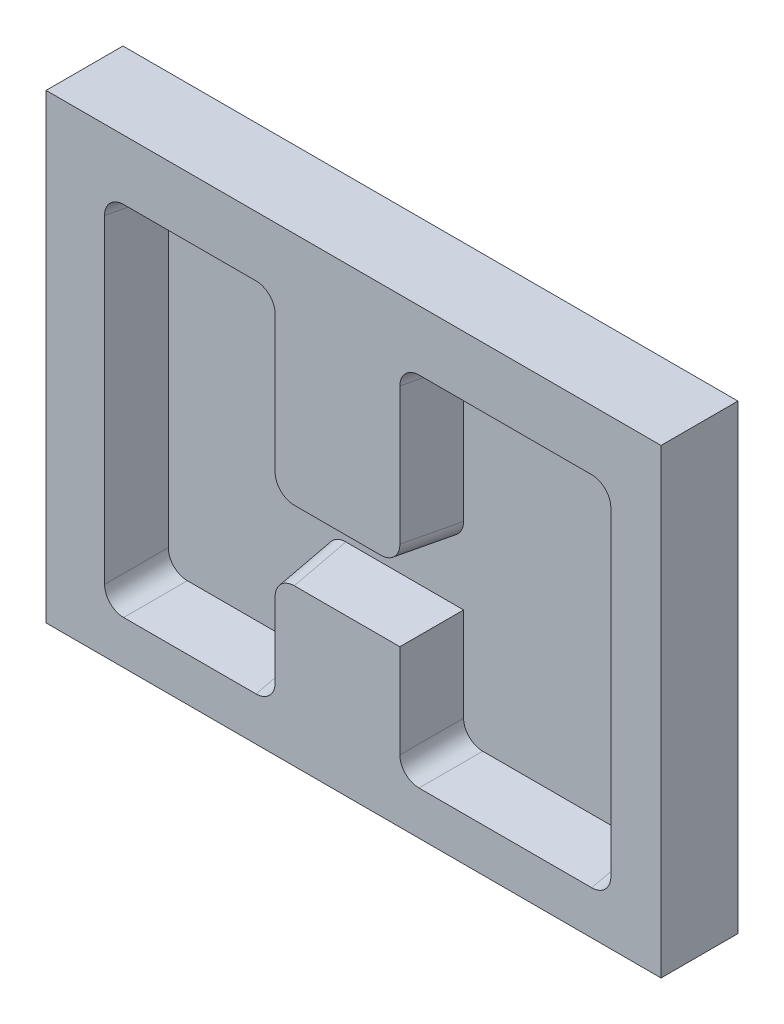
ISO-10303-21;
HEADER;
FILE_DESCRIPTION(('STEP AP214'),'2;1');
FILE_NAME('part.step','',(''),(''),'','','');
FILE_SCHEMA(('AUTOMOTIVE_DESIGN { 1 0 10303 214 1 1 1 1 }'));
ENDSEC;
DATA;
#1=APPLICATION_CONTEXT('core data for automotive mechanical design processes');
#2=APPLICATION_PROTOCOL_DEFINITION('international standard','automotive_design',2000,#1);
#3=PRODUCT_CONTEXT('',#1,'mechanical');
#4=PRODUCT('Part','Part','',(#3));
#5=PRODUCT_RELATED_PRODUCT_CATEGORY('part','',(#4));
#6=PRODUCT_DEFINITION_FORMATION('','',#4);
#7=PRODUCT_DEFINITION_CONTEXT('part definition',#1,'design');
#8=PRODUCT_DEFINITION('design','',#6,#7);
#9=PRODUCT_DEFINITION_SHAPE('','',#8);
#10=(LENGTH_UNIT() NAMED_UNIT(*) SI_UNIT(.MILLI.,.METRE.));
#11=(NAMED_UNIT(*) PLANE_ANGLE_UNIT() SI_UNIT($,.RADIAN.));
#12=(NAMED_UNIT(*) SI_UNIT($,.STERADIAN.) SOLID_ANGLE_UNIT());
#13=UNCERTAINTY_MEASURE_WITH_UNIT(LENGTH_MEASURE(1.E-05),#10,'distance_accuracy_value','');
#14=(GEOMETRIC_REPRESENTATION_CONTEXT(3) GLOBAL_UNCERTAINTY_ASSIGNED_CONTEXT((#13)) GLOBAL_UNIT_ASSIGNED_CONTEXT((#10,
#11,#12)) REPRESENTATION_CONTEXT('',''));
#15=CARTESIAN_POINT('',(0.,0.,0.));
#16=DIRECTION('',(0.,0.,1.));
#17=DIRECTION('',(1.,0.,0.));
#18=AXIS2_PLACEMENT_3D('',#15,#16,#17);
#19=CARTESIAN_POINT('',(0.,0.,25.4));
#20=DIRECTION('',(1.,0.,0.));
#21=DIRECTION('',(0.,0.,-1.));
#22=AXIS2_PLACEMENT_3D('',#19,#20,#21);
#23=PLANE('',#22);
#24=DIRECTION('',(0.,-1.,0.));
#25=VECTOR('',#24,1.);
#26=CARTESIAN_POINT('',(0.,0.,0.));
#27=LINE('',#26,#25);
#28=CARTESIAN_POINT('',(0.,152.4,0.));
#29=VERTEX_POINT('',#28);
#30=CARTESIAN_POINT('',(0.,0.,0.));
#31=VERTEX_POINT('',#30);
#32=EDGE_CURVE('E242',#29,#31,#27,.T.);
#33=ORIENTED_EDGE('',*,*,#32,.T.);
#34=DIRECTION('',(0.,0.,-1.));
#35=VECTOR('',#34,1.);
#36=CARTESIAN_POINT('',(0.,0.,25.4));
#37=LINE('',#36,#35);
#38=CARTESIAN_POINT('',(0.,0.,25.4));
#39=VERTEX_POINT('',#38);
#40=EDGE_CURVE('E330',#39,#31,#37,.T.);
#41=ORIENTED_EDGE('',*,*,#40,.F.);
#42=DIRECTION('',(0.,-1.,0.));
#43=VECTOR('',#42,1.);
#44=CARTESIAN_POINT('',(0.,0.,25.4));
#45=LINE('',#44,#43);
#46=CARTESIAN_POINT('',(0.,152.4,25.4));
#47=VERTEX_POINT('',#46);
#48=EDGE_CURVE('E304',#47,#39,#45,.T.);
#49=ORIENTED_EDGE('',*,*,#48,.F.);
#50=DIRECTION('',(0.,0.,-1.));
#51=VECTOR('',#50,1.);
#52=CARTESIAN_POINT('',(0.,152.4,25.4));
#53=LINE('',#52,#51);
#54=EDGE_CURVE('E314',#47,#29,#53,.T.);
#55=ORIENTED_EDGE('',*,*,#54,.T.);
#56=EDGE_LOOP('',(#33,#41,#49,#55));
#57=FACE_BOUND('',#56,.T.);
#58=ADVANCED_FACE('F43',(#57),#23,.F.);
#59=CARTESIAN_POINT('',(0.,0.,25.4));
#60=DIRECTION('',(0.,1.,0.));
#61=DIRECTION('',(0.,0.,1.));
#62=AXIS2_PLACEMENT_3D('',#59,#60,#61);
#63=PLANE('',#62);
#64=DIRECTION('',(1.,0.,0.));
#65=VECTOR('',#64,1.);
#66=CARTESIAN_POINT('',(0.,0.,0.));
#67=LINE('',#66,#65);
#68=CARTESIAN_POINT('',(203.2,0.,0.));
#69=VERTEX_POINT('',#68);
#70=EDGE_CURVE('E317',#31,#69,#67,.T.);
#71=ORIENTED_EDGE('',*,*,#70,.T.);
#72=DIRECTION('',(0.,0.,-1.));
#73=VECTOR('',#72,1.);
#74=CARTESIAN_POINT('',(203.2,0.,25.4));
#75=LINE('',#74,#73);
#76=CARTESIAN_POINT('',(203.2,0.,25.4));
#77=VERTEX_POINT('',#76);
#78=EDGE_CURVE('E327',#77,#69,#75,.T.);
#79=ORIENTED_EDGE('',*,*,#78,.F.);
#80=DIRECTION('',(1.,0.,0.));
#81=VECTOR('',#80,1.);
#82=CARTESIAN_POINT('',(0.,0.,25.4));
#83=LINE('',#82,#81);
#84=EDGE_CURVE('E307',#39,#77,#83,.T.);
#85=ORIENTED_EDGE('',*,*,#84,.F.);
#86=ORIENTED_EDGE('',*,*,#40,.T.);
#87=EDGE_LOOP('',(#71,#79,#85,#86));
#88=FACE_BOUND('',#87,.T.);
#89=ADVANCED_FACE('F516',(#88),#63,.F.);
#90=CARTESIAN_POINT('',(203.2,0.,25.4));
#91=DIRECTION('',(-1.,0.,0.));
#92=DIRECTION('',(0.,0.,1.));
#93=AXIS2_PLACEMENT_3D('',#90,#91,#92);
#94=PLANE('',#93);
#95=DIRECTION('',(0.,1.,0.));
#96=VECTOR('',#95,1.);
#97=CARTESIAN_POINT('',(203.2,0.,0.));
#98=LINE('',#97,#96);
#99=CARTESIAN_POINT('',(203.2,152.4,0.));
#100=VERTEX_POINT('',#99);
#101=EDGE_CURVE('E319',#69,#100,#98,.T.);
#102=ORIENTED_EDGE('',*,*,#101,.T.);
#103=DIRECTION('',(0.,0.,-1.));
#104=VECTOR('',#103,1.);
#105=CARTESIAN_POINT('',(203.2,152.4,25.4));
#106=LINE('',#105,#104);
#107=CARTESIAN_POINT('',(203.2,152.4,25.4));
#108=VERTEX_POINT('',#107);
#109=EDGE_CURVE('E324',#108,#100,#106,.T.);
#110=ORIENTED_EDGE('',*,*,#109,.F.);
#111=DIRECTION('',(0.,1.,0.));
#112=VECTOR('',#111,1.);
#113=CARTESIAN_POINT('',(203.2,0.,25.4));
#114=LINE('',#113,#112);
#115=EDGE_CURVE('E310',#77,#108,#114,.T.);
#116=ORIENTED_EDGE('',*,*,#115,.F.);
#117=ORIENTED_EDGE('',*,*,#78,.T.);
#118=EDGE_LOOP('',(#102,#110,#116,#117));
#119=FACE_BOUND('',#118,.T.);
#120=ADVANCED_FACE('F522',(#119),#94,.F.);
#121=CARTESIAN_POINT('',(0.,152.4,25.4));
#122=DIRECTION('',(0.,-1.,0.));
#123=DIRECTION('',(0.,0.,-1.));
#124=AXIS2_PLACEMENT_3D('',#121,#122,#123);
#125=PLANE('',#124);
#126=DIRECTION('',(-1.,0.,0.));
#127=VECTOR('',#126,1.);
#128=CARTESIAN_POINT('',(0.,152.4,0.));
#129=LINE('',#128,#127);
#130=EDGE_CURVE('E308',#100,#29,#129,.T.);
#131=ORIENTED_EDGE('',*,*,#130,.T.);
#132=ORIENTED_EDGE('',*,*,#54,.F.);
#133=DIRECTION('',(-1.,0.,0.));
#134=VECTOR('',#133,1.);
#135=CARTESIAN_POINT('',(0.,152.4,25.4));
#136=LINE('',#135,#134);
#137=EDGE_CURVE('E312',#108,#47,#136,.T.);
#138=ORIENTED_EDGE('',*,*,#137,.F.);
#139=ORIENTED_EDGE('',*,*,#109,.T.);
#140=EDGE_LOOP('',(#131,#132,#138,#139));
#141=FACE_BOUND('',#140,.T.);
#142=ADVANCED_FACE('F789',(#141),#125,.F.);
#143=CARTESIAN_POINT('',(0.,152.4,25.4));
#144=DIRECTION('',(0.,0.,-1.));
#145=DIRECTION('',(-1.,0.,0.));
#146=AXIS2_PLACEMENT_3D('',#143,#144,#145);
#147=PLANE('',#146);
#148=DIRECTION('',(1.,0.,0.));
#149=VECTOR('',#148,1.);
#150=CARTESIAN_POINT('',(116.904399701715,51.6523489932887,25.4));
#151=LINE('',#150,#149);
#152=CARTESIAN_POINT('',(82.0038046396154,51.6523489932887,25.4));
#153=VERTEX_POINT('',#152);
#154=CARTESIAN_POINT('',(116.904399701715,51.6523489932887,25.4));
#155=VERTEX_POINT('',#154);
#156=EDGE_CURVE('E224',#153,#155,#151,.T.);
#157=ORIENTED_EDGE('',*,*,#156,.F.);
#158=CARTESIAN_POINT('',(82.0735681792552,45.2673714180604,25.4));
#159=DIRECTION('',(0.,0.,-1.));
#160=DIRECTION('',(0.707106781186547,-0.707106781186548,0.));
#161=AXIS2_PLACEMENT_3D('',#158,#159,#160);
#162=ELLIPSE('',#161,6.41976458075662,6.35);
#163=CARTESIAN_POINT('',(75.6885906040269,45.3371349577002,25.4));
#164=VERTEX_POINT('',#163);
#165=EDGE_CURVE('E386',#153,#164,#162,.F.);
#166=ORIENTED_EDGE('',*,*,#165,.T.);
#167=DIRECTION('',(0.,1.,0.));
#168=VECTOR('',#167,1.);
#169=CARTESIAN_POINT('',(75.6885906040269,51.6523489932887,25.4));
#170=LINE('',#169,#168);
#171=CARTESIAN_POINT('',(75.6885906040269,20.6915003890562,25.4));
#172=VERTEX_POINT('',#171);
#173=EDGE_CURVE('E234',#172,#164,#170,.T.);
#174=ORIENTED_EDGE('',*,*,#173,.F.);
#175=CARTESIAN_POINT('',(69.3036130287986,20.761263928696,25.4));
#176=DIRECTION('',(0.,0.,-1.));
#177=DIRECTION('',(-0.707106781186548,0.707106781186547,0.));
#178=AXIS2_PLACEMENT_3D('',#175,#176,#177);
#179=ELLIPSE('',#178,6.41976458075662,6.35);
#180=CARTESIAN_POINT('',(69.3733765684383,14.3762863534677,25.4));
#181=VERTEX_POINT('',#180);
#182=EDGE_CURVE('E412',#172,#181,#179,.T.);
#183=ORIENTED_EDGE('',*,*,#182,.T.);
#184=DIRECTION('',(1.,0.,0.));
#185=VECTOR('',#184,1.);
#186=CARTESIAN_POINT('',(75.6885906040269,14.3762863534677,25.4));
#187=LINE('',#186,#185);
#188=CARTESIAN_POINT('',(25.6351245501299,14.3762863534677,25.4));
#189=VERTEX_POINT('',#188);
#190=EDGE_CURVE('E482',#189,#181,#187,.T.);
#191=ORIENTED_EDGE('',*,*,#190,.F.);
#192=CARTESIAN_POINT('',(25.7048880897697,20.761263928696,25.4));
#193=DIRECTION('',(0.,0.,-1.));
#194=DIRECTION('',(0.707106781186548,0.707106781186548,0.));
#195=AXIS2_PLACEMENT_3D('',#192,#193,#194);
#196=ELLIPSE('',#195,6.41976458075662,6.35);
#197=CARTESIAN_POINT('',(19.3199105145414,20.6915003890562,25.4));
#198=VERTEX_POINT('',#197);
#199=EDGE_CURVE('E410',#189,#198,#196,.T.);
#200=ORIENTED_EDGE('',*,*,#199,.T.);
#201=DIRECTION('',(0.,-1.,0.));
#202=VECTOR('',#201,1.);
#203=CARTESIAN_POINT('',(19.3199105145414,132.568680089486,25.4));
#204=LINE('',#203,#202);
#205=CARTESIAN_POINT('',(19.3199105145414,126.253466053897,25.4));
#206=VERTEX_POINT('',#205);
#207=EDGE_CURVE('E484',#206,#198,#204,.T.);
#208=ORIENTED_EDGE('',*,*,#207,.F.);
#209=CARTESIAN_POINT('',(25.7048880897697,126.183702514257,25.4));
#210=DIRECTION('',(0.,0.,-1.));
#211=DIRECTION('',(0.707106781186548,-0.707106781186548,0.));
#212=AXIS2_PLACEMENT_3D('',#209,#210,#211);
#213=ELLIPSE('',#212,6.41976458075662,6.35);
#214=CARTESIAN_POINT('',(25.6351245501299,132.568680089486,25.4));
#215=VERTEX_POINT('',#214);
#216=EDGE_CURVE('E11',#206,#215,#213,.T.);
#217=ORIENTED_EDGE('',*,*,#216,.T.);
#218=DIRECTION('',(-1.,0.,0.));
#219=VECTOR('',#218,1.);
#220=CARTESIAN_POINT('',(19.3199105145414,132.568680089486,25.4));
#221=LINE('',#220,#219);
#222=CARTESIAN_POINT('',(69.3733765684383,132.568680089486,25.4));
#223=VERTEX_POINT('',#222);
#224=EDGE_CURVE('E269',#223,#215,#221,.T.);
#225=ORIENTED_EDGE('',*,*,#224,.F.);
#226=CARTESIAN_POINT('',(69.3036130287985,126.183702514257,25.4));
#227=DIRECTION('',(0.,0.,-1.));
#228=DIRECTION('',(-0.707106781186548,-0.707106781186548,0.));
#229=AXIS2_PLACEMENT_3D('',#226,#227,#228);
#230=ELLIPSE('',#229,6.41976458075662,6.35);
#231=CARTESIAN_POINT('',(75.6885906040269,126.253466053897,25.4));
#232=VERTEX_POINT('',#231);
#233=EDGE_CURVE('E408',#223,#232,#230,.T.);
#234=ORIENTED_EDGE('',*,*,#233,.T.);
#235=DIRECTION('',(0.,1.,0.));
#236=VECTOR('',#235,1.);
#237=CARTESIAN_POINT('',(75.6885906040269,132.568680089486,25.4));
#238=LINE('',#237,#236);
#239=CARTESIAN_POINT('',(75.6885906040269,80.9999269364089,25.4));
#240=VERTEX_POINT('',#239);
#241=EDGE_CURVE('E266',#240,#232,#238,.T.);
#242=ORIENTED_EDGE('',*,*,#241,.F.);
#243=CARTESIAN_POINT('',(82.0735681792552,81.0696904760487,25.4));
#244=DIRECTION('',(0.,0.,-1.));
#245=DIRECTION('',(0.707106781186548,0.707106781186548,0.));
#246=AXIS2_PLACEMENT_3D('',#243,#244,#245);
#247=ELLIPSE('',#246,6.41976458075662,6.35);
#248=CARTESIAN_POINT('',(82.0038046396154,74.6847129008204,25.4));
#249=VERTEX_POINT('',#248);
#250=EDGE_CURVE('E382',#240,#249,#247,.F.);
#251=ORIENTED_EDGE('',*,*,#250,.T.);
#252=DIRECTION('',(-1.,0.,0.));
#253=VECTOR('',#252,1.);
#254=CARTESIAN_POINT('',(75.6885906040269,74.6847129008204,25.4));
#255=LINE('',#254,#253);
#256=CARTESIAN_POINT('',(110.589185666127,74.6847129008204,25.4));
#257=VERTEX_POINT('',#256);
#258=EDGE_CURVE('E263',#257,#249,#255,.T.);
#259=ORIENTED_EDGE('',*,*,#258,.F.);
#260=CARTESIAN_POINT('',(110.519422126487,81.0696904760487,25.4));
#261=DIRECTION('',(0.,0.,-1.));
#262=DIRECTION('',(-0.707106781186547,0.707106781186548,0.));
#263=AXIS2_PLACEMENT_3D('',#260,#261,#262);
#264=ELLIPSE('',#263,6.41976458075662,6.35);
#265=CARTESIAN_POINT('',(116.904399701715,80.9999269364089,25.4));
#266=VERTEX_POINT('',#265);
#267=EDGE_CURVE('E384',#257,#266,#264,.F.);
#268=ORIENTED_EDGE('',*,*,#267,.T.);
#269=DIRECTION('',(0.,-1.,0.));
#270=VECTOR('',#269,1.);
#271=CARTESIAN_POINT('',(116.904399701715,74.6847129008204,25.4));
#272=LINE('',#271,#270);
#273=CARTESIAN_POINT('',(116.904399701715,126.253466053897,25.4));
#274=VERTEX_POINT('',#273);
#275=EDGE_CURVE('E260',#274,#266,#272,.T.);
#276=ORIENTED_EDGE('',*,*,#275,.F.);
#277=CARTESIAN_POINT('',(123.289377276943,126.183702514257,25.4));
#278=DIRECTION('',(0.,0.,-1.));
#279=DIRECTION('',(0.707106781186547,-0.707106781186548,0.));
#280=AXIS2_PLACEMENT_3D('',#277,#278,#279);
#281=ELLIPSE('',#280,6.41976458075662,6.35);
#282=CARTESIAN_POINT('',(123.219613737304,132.568680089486,25.4));
#283=VERTEX_POINT('',#282);
#284=EDGE_CURVE('E418',#274,#283,#281,.T.);
#285=ORIENTED_EDGE('',*,*,#284,.T.);
#286=DIRECTION('',(-1.,0.,0.));
#287=VECTOR('',#286,1.);
#288=CARTESIAN_POINT('',(116.904399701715,132.568680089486,25.4));
#289=LINE('',#288,#287);
#290=CARTESIAN_POINT('',(180.292392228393,132.568680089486,25.4));
#291=VERTEX_POINT('',#290);
#292=EDGE_CURVE('E257',#291,#283,#289,.T.);
#293=ORIENTED_EDGE('',*,*,#292,.F.);
#294=CARTESIAN_POINT('',(180.222628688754,126.183702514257,25.4));
#295=DIRECTION('',(0.,0.,-1.));
#296=DIRECTION('',(-0.707106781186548,-0.707106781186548,0.));
#297=AXIS2_PLACEMENT_3D('',#294,#295,#296);
#298=ELLIPSE('',#297,6.41976458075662,6.35);
#299=CARTESIAN_POINT('',(186.607606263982,126.253466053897,25.4));
#300=VERTEX_POINT('',#299);
#301=EDGE_CURVE('E58',#291,#300,#298,.T.);
#302=ORIENTED_EDGE('',*,*,#301,.T.);
#303=DIRECTION('',(0.,1.,0.));
#304=VECTOR('',#303,1.);
#305=CARTESIAN_POINT('',(186.607606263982,132.568680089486,25.4));
#306=LINE('',#305,#304);
#307=CARTESIAN_POINT('',(186.607606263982,20.6915003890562,25.4));
#308=VERTEX_POINT('',#307);
#309=EDGE_CURVE('E252',#308,#300,#306,.T.);
#310=ORIENTED_EDGE('',*,*,#309,.F.);
#311=CARTESIAN_POINT('',(180.222628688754,20.761263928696,25.4));
#312=DIRECTION('',(0.,0.,-1.));
#313=DIRECTION('',(-0.707106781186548,0.707106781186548,0.));
#314=AXIS2_PLACEMENT_3D('',#311,#312,#313);
#315=ELLIPSE('',#314,6.41976458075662,6.35);
#316=CARTESIAN_POINT('',(180.292392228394,14.3762863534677,25.4));
#317=VERTEX_POINT('',#316);
#318=EDGE_CURVE('E66',#308,#317,#315,.T.);
#319=ORIENTED_EDGE('',*,*,#318,.T.);
#320=DIRECTION('',(1.,0.,0.));
#321=VECTOR('',#320,1.);
#322=CARTESIAN_POINT('',(186.607606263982,14.3762863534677,25.4));
#323=LINE('',#322,#321);
#324=CARTESIAN_POINT('',(123.219613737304,14.3762863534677,25.4));
#325=VERTEX_POINT('',#324);
#326=EDGE_CURVE('E249',#325,#317,#323,.T.);
#327=ORIENTED_EDGE('',*,*,#326,.F.);
#328=CARTESIAN_POINT('',(123.289377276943,20.761263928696,25.4));
#329=DIRECTION('',(0.,0.,-1.));
#330=DIRECTION('',(0.707106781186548,0.707106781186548,0.));
#331=AXIS2_PLACEMENT_3D('',#328,#329,#330);
#332=ELLIPSE('',#331,6.41976458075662,6.35);
#333=CARTESIAN_POINT('',(116.904399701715,20.6915003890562,25.4));
#334=VERTEX_POINT('',#333);
#335=EDGE_CURVE('E248',#325,#334,#332,.T.);
#336=ORIENTED_EDGE('',*,*,#335,.T.);
#337=DIRECTION('',(0.,-1.,0.));
#338=VECTOR('',#337,1.);
#339=CARTESIAN_POINT('',(116.904399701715,14.3762863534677,25.4));
#340=LINE('',#339,#338);
#341=EDGE_CURVE('E233',#155,#334,#340,.T.);
#342=ORIENTED_EDGE('',*,*,#341,.F.);
#343=EDGE_LOOP('',(#157,#166,#174,#183,#191,#200,#208,#217,#225,#234,#242,#251,#259,#268,#276,
#285,#293,#302,#310,#319,#327,#336,#342));
#344=FACE_BOUND('',#343,.T.);
#345=ORIENTED_EDGE('',*,*,#48,.T.);
#346=ORIENTED_EDGE('',*,*,#84,.T.);
#347=ORIENTED_EDGE('',*,*,#115,.T.);
#348=ORIENTED_EDGE('',*,*,#137,.T.);
#349=EDGE_LOOP('',(#345,#346,#347,#348));
#350=FACE_BOUND('',#349,.T.);
#351=ADVANCED_FACE('F245',(#344,#350),#147,.F.);
#352=CARTESIAN_POINT('',(0.,152.4,0.));
#353=DIRECTION('',(0.,0.,-1.));
#354=DIRECTION('',(-1.,0.,0.));
#355=AXIS2_PLACEMENT_3D('',#352,#353,#354);
#356=PLANE('',#355);
#357=ORIENTED_EDGE('',*,*,#32,.F.);
#358=ORIENTED_EDGE('',*,*,#130,.F.);
#359=ORIENTED_EDGE('',*,*,#101,.F.);
#360=ORIENTED_EDGE('',*,*,#70,.F.);
#361=EDGE_LOOP('',(#357,#358,#359,#360));
#362=FACE_BOUND('',#361,.T.);
#363=ADVANCED_FACE('F770',(#362),#356,.T.);
#364=CARTESIAN_POINT('',(19.3199105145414,132.568680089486,25.4));
#365=DIRECTION('',(-0.994521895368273,0.,-0.104528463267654));
#366=DIRECTION('',(-0.104528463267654,0.,0.994521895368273));
#367=AXIS2_PLACEMENT_3D('',#364,#365,#366);
#368=PLANE('',#367);
#369=ORIENTED_EDGE('',*,*,#207,.T.);
#370=DIRECTION('',(-0.103962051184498,-0.103962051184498,0.989132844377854));
#371=VECTOR('',#370,1.);
#372=CARTESIAN_POINT('',(21.2538906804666,22.6254805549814,6.99940785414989));
#373=LINE('',#372,#371);
#374=CARTESIAN_POINT('',(21.3221461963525,22.6937360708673,6.35));
#375=VERTEX_POINT('',#374);
#376=EDGE_CURVE('E374',#198,#375,#373,.F.);
#377=ORIENTED_EDGE('',*,*,#376,.T.);
#378=DIRECTION('',(0.,-1.,0.));
#379=VECTOR('',#378,1.);
#380=CARTESIAN_POINT('',(21.3221461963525,132.568680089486,6.35));
#381=LINE('',#380,#379);
#382=CARTESIAN_POINT('',(21.3221461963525,124.251230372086,6.35));
#383=VERTEX_POINT('',#382);
#384=EDGE_CURVE('E271',#383,#375,#381,.T.);
#385=ORIENTED_EDGE('',*,*,#384,.F.);
#386=DIRECTION('',(-0.103962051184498,0.103962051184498,0.989132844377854));
#387=VECTOR('',#386,1.);
#388=CARTESIAN_POINT('',(19.2516549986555,126.321721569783,26.0494078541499));
#389=LINE('',#388,#387);
#390=EDGE_CURVE('E371',#383,#206,#389,.T.);
#391=ORIENTED_EDGE('',*,*,#390,.T.);
#392=EDGE_LOOP('',(#369,#377,#385,#391));
#393=FACE_BOUND('',#392,.T.);
#394=ADVANCED_FACE('F491',(#393),#368,.F.);
#395=CARTESIAN_POINT('',(19.3199105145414,132.568680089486,25.4));
#396=DIRECTION('',(0.,0.994521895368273,-0.104528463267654));
#397=DIRECTION('',(0.,0.104528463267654,0.994521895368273));
#398=AXIS2_PLACEMENT_3D('',#395,#396,#397);
#399=PLANE('',#398);
#400=DIRECTION('',(-1.,0.,0.));
#401=VECTOR('',#400,1.);
#402=CARTESIAN_POINT('',(19.3199105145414,130.566444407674,6.35));
#403=LINE('',#402,#401);
#404=CARTESIAN_POINT('',(67.3711408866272,130.566444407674,6.35));
#405=VERTEX_POINT('',#404);
#406=CARTESIAN_POINT('',(27.6373602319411,130.566444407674,6.35));
#407=VERTEX_POINT('',#406);
#408=EDGE_CURVE('E243',#405,#407,#403,.T.);
#409=ORIENTED_EDGE('',*,*,#408,.F.);
#410=DIRECTION('',(0.103962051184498,0.103962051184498,0.989132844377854));
#411=VECTOR('',#410,1.);
#412=CARTESIAN_POINT('',(69.4416320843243,132.636935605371,26.0494078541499));
#413=LINE('',#412,#411);
#414=EDGE_CURVE('E358',#405,#223,#413,.T.);
#415=ORIENTED_EDGE('',*,*,#414,.T.);
#416=ORIENTED_EDGE('',*,*,#224,.T.);
#417=DIRECTION('',(-0.103962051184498,0.103962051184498,0.989132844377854));
#418=VECTOR('',#417,1.);
#419=CARTESIAN_POINT('',(27.5691047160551,130.63469992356,6.99940785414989));
#420=LINE('',#419,#418);
#421=EDGE_CURVE('E356',#215,#407,#420,.F.);
#422=ORIENTED_EDGE('',*,*,#421,.T.);
#423=EDGE_LOOP('',(#409,#415,#416,#422));
#424=FACE_BOUND('',#423,.T.);
#425=ADVANCED_FACE('F537',(#424),#399,.F.);
#426=CARTESIAN_POINT('',(75.6885906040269,132.568680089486,25.4));
#427=DIRECTION('',(0.994521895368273,0.,-0.104528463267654));
#428=DIRECTION('',(-0.104528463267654,0.,-0.994521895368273));
#429=AXIS2_PLACEMENT_3D('',#426,#427,#428);
#430=PLANE('',#429);
#431=ORIENTED_EDGE('',*,*,#241,.T.);
#432=DIRECTION('',(0.103962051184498,0.103962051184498,0.989132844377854));
#433=VECTOR('',#432,1.);
#434=CARTESIAN_POINT('',(73.7546104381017,124.319485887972,6.99940785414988));
#435=LINE('',#434,#433);
#436=CARTESIAN_POINT('',(73.6863549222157,124.251230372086,6.35));
#437=VERTEX_POINT('',#436);
#438=EDGE_CURVE('E364',#232,#437,#435,.F.);
#439=ORIENTED_EDGE('',*,*,#438,.T.);
#440=DIRECTION('',(0.,1.,0.));
#441=VECTOR('',#440,1.);
#442=CARTESIAN_POINT('',(73.6863549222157,132.568680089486,6.35));
#443=LINE('',#442,#441);
#444=CARTESIAN_POINT('',(73.6863549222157,78.9976912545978,6.35));
#445=VERTEX_POINT('',#444);
#446=EDGE_CURVE('E278',#445,#437,#443,.T.);
#447=ORIENTED_EDGE('',*,*,#446,.F.);
#448=DIRECTION('',(0.103962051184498,0.103962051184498,0.989132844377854));
#449=VECTOR('',#448,1.);
#450=CARTESIAN_POINT('',(76.2459512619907,81.5572875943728,30.7029324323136));
#451=LINE('',#450,#449);
#452=EDGE_CURVE('E361',#445,#240,#451,.T.);
#453=ORIENTED_EDGE('',*,*,#452,.T.);
#454=EDGE_LOOP('',(#431,#439,#447,#453));
#455=FACE_BOUND('',#454,.T.);
#456=ADVANCED_FACE('F431',(#455),#430,.F.);
#457=CARTESIAN_POINT('',(75.6885906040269,74.6847129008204,25.4));
#458=DIRECTION('',(0.,0.994521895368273,-0.104528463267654));
#459=DIRECTION('',(0.,0.104528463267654,0.994521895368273));
#460=AXIS2_PLACEMENT_3D('',#457,#458,#459);
#461=PLANE('',#460);
#462=DIRECTION('',(-1.,0.,0.));
#463=VECTOR('',#462,1.);
#464=CARTESIAN_POINT('',(75.6885906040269,72.6824772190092,6.35));
#465=LINE('',#464,#463);
#466=CARTESIAN_POINT('',(112.591421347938,72.6824772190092,6.35));
#467=VERTEX_POINT('',#466);
#468=CARTESIAN_POINT('',(80.0015689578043,72.6824772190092,6.35));
#469=VERTEX_POINT('',#468);
#470=EDGE_CURVE('E281',#467,#469,#465,.T.);
#471=ORIENTED_EDGE('',*,*,#470,.F.);
#472=DIRECTION('',(-0.103962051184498,0.103962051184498,0.989132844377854));
#473=VECTOR('',#472,1.);
#474=CARTESIAN_POINT('',(110.211976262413,75.0619223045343,28.9889077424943));
#475=LINE('',#474,#473);
#476=EDGE_CURVE('E404',#467,#257,#475,.T.);
#477=ORIENTED_EDGE('',*,*,#476,.T.);
#478=ORIENTED_EDGE('',*,*,#258,.T.);
#479=DIRECTION('',(0.103962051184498,0.103962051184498,0.989132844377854));
#480=VECTOR('',#479,1.);
#481=CARTESIAN_POINT('',(81.9355491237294,74.6164573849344,24.7505921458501));
#482=LINE('',#481,#480);
#483=EDGE_CURVE('E402',#249,#469,#482,.F.);
#484=ORIENTED_EDGE('',*,*,#483,.T.);
#485=EDGE_LOOP('',(#471,#477,#478,#484));
#486=FACE_BOUND('',#485,.T.);
#487=ADVANCED_FACE('F437',(#486),#461,.F.);
#488=CARTESIAN_POINT('',(116.904399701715,74.6847129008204,25.4));
#489=DIRECTION('',(-0.994521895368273,0.,-0.104528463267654));
#490=DIRECTION('',(-0.104528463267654,0.,0.994521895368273));
#491=AXIS2_PLACEMENT_3D('',#488,#489,#490);
#492=PLANE('',#491);
#493=DIRECTION('',(0.,-1.,0.));
#494=VECTOR('',#493,1.);
#495=CARTESIAN_POINT('',(118.906635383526,74.6847129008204,6.35));
#496=LINE('',#495,#494);
#497=CARTESIAN_POINT('',(118.906635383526,124.251230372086,6.35));
#498=VERTEX_POINT('',#497);
#499=CARTESIAN_POINT('',(118.906635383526,78.9976912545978,6.35));
#500=VERTEX_POINT('',#499);
#501=EDGE_CURVE('E284',#498,#500,#496,.T.);
#502=ORIENTED_EDGE('',*,*,#501,.F.);
#503=DIRECTION('',(-0.103962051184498,0.103962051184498,0.989132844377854));
#504=VECTOR('',#503,1.);
#505=CARTESIAN_POINT('',(116.836144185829,126.321721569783,26.0494078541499));
#506=LINE('',#505,#504);
#507=EDGE_CURVE('E399',#498,#274,#506,.T.);
#508=ORIENTED_EDGE('',*,*,#507,.T.);
#509=ORIENTED_EDGE('',*,*,#275,.T.);
#510=DIRECTION('',(-0.103962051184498,0.103962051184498,0.989132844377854));
#511=VECTOR('',#510,1.);
#512=CARTESIAN_POINT('',(116.972655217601,80.931671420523,24.7505921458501));
#513=LINE('',#512,#511);
#514=EDGE_CURVE('E397',#266,#500,#513,.F.);
#515=ORIENTED_EDGE('',*,*,#514,.T.);
#516=EDGE_LOOP('',(#502,#508,#509,#515));
#517=FACE_BOUND('',#516,.T.);
#518=ADVANCED_FACE('F446',(#517),#492,.F.);
#519=CARTESIAN_POINT('',(116.904399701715,132.568680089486,25.4));
#520=DIRECTION('',(0.,0.994521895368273,-0.104528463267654));
#521=DIRECTION('',(0.,0.104528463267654,0.994521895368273));
#522=AXIS2_PLACEMENT_3D('',#519,#520,#521);
#523=PLANE('',#522);
#524=DIRECTION('',(-1.,0.,0.));
#525=VECTOR('',#524,1.);
#526=CARTESIAN_POINT('',(116.904399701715,130.566444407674,6.35));
#527=LINE('',#526,#525);
#528=CARTESIAN_POINT('',(178.290156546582,130.566444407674,6.35));
#529=VERTEX_POINT('',#528);
#530=CARTESIAN_POINT('',(125.221849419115,130.566444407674,6.35));
#531=VERTEX_POINT('',#530);
#532=EDGE_CURVE('E287',#529,#531,#527,.T.);
#533=ORIENTED_EDGE('',*,*,#532,.F.);
#534=DIRECTION('',(0.103962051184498,0.103962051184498,0.989132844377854));
#535=VECTOR('',#534,1.);
#536=CARTESIAN_POINT('',(180.360647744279,132.636935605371,26.0494078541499));
#537=LINE('',#536,#535);
#538=EDGE_CURVE('E394',#529,#291,#537,.T.);
#539=ORIENTED_EDGE('',*,*,#538,.T.);
#540=ORIENTED_EDGE('',*,*,#292,.T.);
#541=DIRECTION('',(-0.103962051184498,0.103962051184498,0.989132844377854));
#542=VECTOR('',#541,1.);
#543=CARTESIAN_POINT('',(125.153593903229,130.63469992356,6.99940785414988));
#544=LINE('',#543,#542);
#545=EDGE_CURVE('E392',#283,#531,#544,.F.);
#546=ORIENTED_EDGE('',*,*,#545,.T.);
#547=EDGE_LOOP('',(#533,#539,#540,#546));
#548=FACE_BOUND('',#547,.T.);
#549=ADVANCED_FACE('F454',(#548),#523,.F.);
#550=CARTESIAN_POINT('',(186.607606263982,132.568680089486,25.4));
#551=DIRECTION('',(0.994521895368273,0.,-0.104528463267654));
#552=DIRECTION('',(-0.104528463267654,0.,-0.994521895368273));
#553=AXIS2_PLACEMENT_3D('',#550,#551,#552);
#554=PLANE('',#553);
#555=DIRECTION('',(0.,1.,0.));
#556=VECTOR('',#555,1.);
#557=CARTESIAN_POINT('',(184.605370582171,132.568680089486,6.35));
#558=LINE('',#557,#556);
#559=CARTESIAN_POINT('',(184.605370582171,22.6937360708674,6.35));
#560=VERTEX_POINT('',#559);
#561=CARTESIAN_POINT('',(184.605370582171,124.251230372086,6.35));
#562=VERTEX_POINT('',#561);
#563=EDGE_CURVE('E290',#560,#562,#558,.T.);
#564=ORIENTED_EDGE('',*,*,#563,.F.);
#565=DIRECTION('',(0.103962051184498,-0.103962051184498,0.989132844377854));
#566=VECTOR('',#565,1.);
#567=CARTESIAN_POINT('',(186.675861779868,20.6232448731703,26.0494078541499));
#568=LINE('',#567,#566);
#569=EDGE_CURVE('E390',#560,#308,#568,.T.);
#570=ORIENTED_EDGE('',*,*,#569,.T.);
#571=ORIENTED_EDGE('',*,*,#309,.T.);
#572=DIRECTION('',(0.103962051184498,0.103962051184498,0.989132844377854));
#573=VECTOR('',#572,1.);
#574=CARTESIAN_POINT('',(184.673626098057,124.319485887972,6.99940785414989));
#575=LINE('',#574,#573);
#576=EDGE_CURVE('E388',#300,#562,#575,.F.);
#577=ORIENTED_EDGE('',*,*,#576,.T.);
#578=EDGE_LOOP('',(#564,#570,#571,#577));
#579=FACE_BOUND('',#578,.T.);
#580=ADVANCED_FACE('F462',(#579),#554,.F.);
#581=CARTESIAN_POINT('',(186.607606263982,14.3762863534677,25.4));
#582=DIRECTION('',(0.,-0.994521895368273,-0.104528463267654));
#583=DIRECTION('',(0.,0.104528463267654,-0.994521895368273));
#584=AXIS2_PLACEMENT_3D('',#581,#582,#583);
#585=PLANE('',#584);
#586=DIRECTION('',(1.,0.,0.));
#587=VECTOR('',#586,1.);
#588=CARTESIAN_POINT('',(186.607606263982,16.3785220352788,6.35));
#589=LINE('',#588,#587);
#590=CARTESIAN_POINT('',(125.221849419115,16.3785220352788,6.35));
#591=VERTEX_POINT('',#590);
#592=CARTESIAN_POINT('',(178.290156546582,16.3785220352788,6.35));
#593=VERTEX_POINT('',#592);
#594=EDGE_CURVE('E293',#591,#593,#589,.T.);
#595=ORIENTED_EDGE('',*,*,#594,.F.);
#596=DIRECTION('',(-0.103962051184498,-0.103962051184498,0.989132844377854));
#597=VECTOR('',#596,1.);
#598=CARTESIAN_POINT('',(123.151358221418,14.3080308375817,26.0494078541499));
#599=LINE('',#598,#597);
#600=EDGE_CURVE('E335',#591,#325,#599,.T.);
#601=ORIENTED_EDGE('',*,*,#600,.T.);
#602=ORIENTED_EDGE('',*,*,#326,.T.);
#603=DIRECTION('',(0.103962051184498,-0.103962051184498,0.989132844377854));
#604=VECTOR('',#603,1.);
#605=CARTESIAN_POINT('',(178.358412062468,16.3102665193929,6.99940785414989));
#606=LINE('',#605,#604);
#607=EDGE_CURVE('E333',#317,#593,#606,.F.);
#608=ORIENTED_EDGE('',*,*,#607,.T.);
#609=EDGE_LOOP('',(#595,#601,#602,#608));
#610=FACE_BOUND('',#609,.T.);
#611=ADVANCED_FACE('F467',(#610),#585,.F.);
#612=CARTESIAN_POINT('',(116.904399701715,14.3762863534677,25.4));
#613=DIRECTION('',(-0.994521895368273,0.,-0.104528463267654));
#614=DIRECTION('',(-0.104528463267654,0.,0.994521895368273));
#615=AXIS2_PLACEMENT_3D('',#612,#613,#614);
#616=PLANE('',#615);
#617=ORIENTED_EDGE('',*,*,#341,.T.);
#618=DIRECTION('',(-0.103962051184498,-0.103962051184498,0.989132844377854));
#619=VECTOR('',#618,1.);
#620=CARTESIAN_POINT('',(118.83837986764,22.6254805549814,6.99940785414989));
#621=LINE('',#620,#619);
#622=CARTESIAN_POINT('',(118.906635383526,22.6937360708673,6.35));
#623=VERTEX_POINT('',#622);
#624=EDGE_CURVE('E338',#334,#623,#621,.F.);
#625=ORIENTED_EDGE('',*,*,#624,.T.);
#626=DIRECTION('',(0.,-1.,0.));
#627=VECTOR('',#626,1.);
#628=CARTESIAN_POINT('',(118.906635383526,14.3762863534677,6.35));
#629=LINE('',#628,#627);
#630=CARTESIAN_POINT('',(118.906635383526,53.6545846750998,6.35));
#631=VERTEX_POINT('',#630);
#632=EDGE_CURVE('E241',#631,#623,#629,.T.);
#633=ORIENTED_EDGE('',*,*,#632,.F.);
#634=DIRECTION('',(-0.103962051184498,-0.103962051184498,0.989132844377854));
#635=VECTOR('',#634,1.);
#636=CARTESIAN_POINT('',(116.501515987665,51.2494652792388,29.2331824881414));
#637=LINE('',#636,#635);
#638=EDGE_CURVE('E228',#631,#155,#637,.T.);
#639=ORIENTED_EDGE('',*,*,#638,.T.);
#640=EDGE_LOOP('',(#617,#625,#633,#639));
#641=FACE_BOUND('',#640,.T.);
#642=ADVANCED_FACE('F238',(#641),#616,.F.);
#643=CARTESIAN_POINT('',(116.904399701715,51.6523489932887,25.4));
#644=DIRECTION('',(0.,-0.994521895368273,-0.104528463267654));
#645=DIRECTION('',(0.,0.104528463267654,-0.994521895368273));
#646=AXIS2_PLACEMENT_3D('',#643,#644,#645);
#647=PLANE('',#646);
#648=DIRECTION('',(1.,0.,0.));
#649=VECTOR('',#648,1.);
#650=CARTESIAN_POINT('',(116.904399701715,53.6545846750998,6.35));
#651=LINE('',#650,#649);
#652=CARTESIAN_POINT('',(80.0015689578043,53.6545846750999,6.35));
#653=VERTEX_POINT('',#652);
#654=EDGE_CURVE('E297',#653,#631,#651,.T.);
#655=ORIENTED_EDGE('',*,*,#654,.F.);
#656=DIRECTION('',(0.103962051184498,-0.103962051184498,0.989132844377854));
#657=VECTOR('',#656,1.);
#658=CARTESIAN_POINT('',(82.3810140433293,51.2751395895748,28.9889077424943));
#659=LINE('',#658,#657);
#660=EDGE_CURVE('E231',#653,#153,#659,.T.);
#661=ORIENTED_EDGE('',*,*,#660,.T.);
#662=ORIENTED_EDGE('',*,*,#156,.T.);
#663=ORIENTED_EDGE('',*,*,#638,.F.);
#664=EDGE_LOOP('',(#655,#661,#662,#663));
#665=FACE_BOUND('',#664,.T.);
#666=ADVANCED_FACE('F227',(#665),#647,.F.);
#667=CARTESIAN_POINT('',(75.6885906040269,51.6523489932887,25.4));
#668=DIRECTION('',(0.994521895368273,0.,-0.104528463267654));
#669=DIRECTION('',(-0.104528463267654,0.,-0.994521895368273));
#670=AXIS2_PLACEMENT_3D('',#667,#668,#669);
#671=PLANE('',#670);
#672=DIRECTION('',(0.,1.,0.));
#673=VECTOR('',#672,1.);
#674=CARTESIAN_POINT('',(73.6863549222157,51.6523489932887,6.35));
#675=LINE('',#674,#673);
#676=CARTESIAN_POINT('',(73.6863549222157,22.6937360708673,6.35));
#677=VERTEX_POINT('',#676);
#678=CARTESIAN_POINT('',(73.6863549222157,47.3393706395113,6.35));
#679=VERTEX_POINT('',#678);
#680=EDGE_CURVE('E299',#677,#679,#675,.T.);
#681=ORIENTED_EDGE('',*,*,#680,.F.);
#682=DIRECTION('',(0.103962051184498,-0.103962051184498,0.989132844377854));
#683=VECTOR('',#682,1.);
#684=CARTESIAN_POINT('',(75.7568461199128,20.6232448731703,26.0494078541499));
#685=LINE('',#684,#683);
#686=EDGE_CURVE('E378',#677,#172,#685,.T.);
#687=ORIENTED_EDGE('',*,*,#686,.T.);
#688=ORIENTED_EDGE('',*,*,#173,.T.);
#689=DIRECTION('',(0.103962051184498,-0.103962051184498,0.989132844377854));
#690=VECTOR('',#689,1.);
#691=CARTESIAN_POINT('',(75.6203350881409,45.4053904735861,24.7505921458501));
#692=LINE('',#691,#690);
#693=EDGE_CURVE('E376',#164,#679,#692,.F.);
#694=ORIENTED_EDGE('',*,*,#693,.T.);
#695=EDGE_LOOP('',(#681,#687,#688,#694));
#696=FACE_BOUND('',#695,.T.);
#697=ADVANCED_FACE('F480',(#696),#671,.F.);
#698=CARTESIAN_POINT('',(75.6885906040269,14.3762863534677,25.4));
#699=DIRECTION('',(0.,-0.994521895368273,-0.104528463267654));
#700=DIRECTION('',(0.,0.104528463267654,-0.994521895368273));
#701=AXIS2_PLACEMENT_3D('',#698,#699,#700);
#702=PLANE('',#701);
#703=DIRECTION('',(1.,0.,0.));
#704=VECTOR('',#703,1.);
#705=CARTESIAN_POINT('',(75.6885906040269,16.3785220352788,6.35));
#706=LINE('',#705,#704);
#707=CARTESIAN_POINT('',(27.6373602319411,16.3785220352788,6.35));
#708=VERTEX_POINT('',#707);
#709=CARTESIAN_POINT('',(67.3711408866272,16.3785220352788,6.35));
#710=VERTEX_POINT('',#709);
#711=EDGE_CURVE('E275',#708,#710,#706,.T.);
#712=ORIENTED_EDGE('',*,*,#711,.F.);
#713=DIRECTION('',(-0.103962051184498,-0.103962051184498,0.989132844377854));
#714=VECTOR('',#713,1.);
#715=CARTESIAN_POINT('',(25.566869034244,14.3080308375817,26.0494078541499));
#716=LINE('',#715,#714);
#717=EDGE_CURVE('E368',#708,#189,#716,.T.);
#718=ORIENTED_EDGE('',*,*,#717,.T.);
#719=ORIENTED_EDGE('',*,*,#190,.T.);
#720=DIRECTION('',(0.103962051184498,-0.103962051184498,0.989132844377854));
#721=VECTOR('',#720,1.);
#722=CARTESIAN_POINT('',(67.4393964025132,16.3102665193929,6.99940785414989));
#723=LINE('',#722,#721);
#724=EDGE_CURVE('E366',#181,#710,#723,.F.);
#725=ORIENTED_EDGE('',*,*,#724,.T.);
#726=EDGE_LOOP('',(#712,#718,#719,#725));
#727=FACE_BOUND('',#726,.T.);
#728=ADVANCED_FACE('F501',(#727),#702,.F.);
#729=CARTESIAN_POINT('',(19.3199105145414,14.3762863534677,6.35));
#730=DIRECTION('',(0.,0.,-1.));
#731=DIRECTION('',(-1.,0.,0.));
#732=AXIS2_PLACEMENT_3D('',#729,#730,#731);
#733=PLANE('',#732);
#734=ORIENTED_EDGE('',*,*,#632,.T.);
#735=CARTESIAN_POINT('',(125.291612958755,22.7634996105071,6.35));
#736=DIRECTION('',(0.,0.,-1.));
#737=DIRECTION('',(0.707106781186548,0.707106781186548,0.));
#738=AXIS2_PLACEMENT_3D('',#735,#736,#737);
#739=ELLIPSE('',#738,6.41976458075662,6.35);
#740=EDGE_CURVE('E354',#623,#591,#739,.F.);
#741=ORIENTED_EDGE('',*,*,#740,.T.);
#742=ORIENTED_EDGE('',*,*,#594,.T.);
#743=CARTESIAN_POINT('',(178.220393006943,22.7634996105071,6.35));
#744=DIRECTION('',(0.,0.,-1.));
#745=DIRECTION('',(-0.707106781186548,0.707106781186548,0.));
#746=AXIS2_PLACEMENT_3D('',#743,#744,#745);
#747=ELLIPSE('',#746,6.41976458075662,6.35);
#748=EDGE_CURVE('E346',#593,#560,#747,.F.);
#749=ORIENTED_EDGE('',*,*,#748,.T.);
#750=ORIENTED_EDGE('',*,*,#563,.T.);
#751=CARTESIAN_POINT('',(178.220393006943,124.181466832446,6.35));
#752=DIRECTION('',(0.,0.,-1.));
#753=DIRECTION('',(-0.707106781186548,-0.707106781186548,0.));
#754=AXIS2_PLACEMENT_3D('',#751,#752,#753);
#755=ELLIPSE('',#754,6.41976458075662,6.35);
#756=EDGE_CURVE('E344',#562,#529,#755,.F.);
#757=ORIENTED_EDGE('',*,*,#756,.T.);
#758=ORIENTED_EDGE('',*,*,#532,.T.);
#759=CARTESIAN_POINT('',(125.291612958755,124.181466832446,6.35));
#760=DIRECTION('',(0.,0.,-1.));
#761=DIRECTION('',(0.707106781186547,-0.707106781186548,0.));
#762=AXIS2_PLACEMENT_3D('',#759,#760,#761);
#763=ELLIPSE('',#762,6.41976458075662,6.35);
#764=EDGE_CURVE('E342',#531,#498,#763,.F.);
#765=ORIENTED_EDGE('',*,*,#764,.T.);
#766=ORIENTED_EDGE('',*,*,#501,.T.);
#767=CARTESIAN_POINT('',(112.521657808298,79.0674547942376,6.35));
#768=DIRECTION('',(0.,0.,-1.));
#769=DIRECTION('',(-0.707106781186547,0.707106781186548,0.));
#770=AXIS2_PLACEMENT_3D('',#767,#768,#769);
#771=ELLIPSE('',#770,6.41976458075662,6.35);
#772=EDGE_CURVE('E420',#500,#467,#771,.T.);
#773=ORIENTED_EDGE('',*,*,#772,.T.);
#774=ORIENTED_EDGE('',*,*,#470,.T.);
#775=CARTESIAN_POINT('',(80.071332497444,79.0674547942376,6.35));
#776=DIRECTION('',(0.,0.,-1.));
#777=DIRECTION('',(0.707106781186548,0.707106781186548,0.));
#778=AXIS2_PLACEMENT_3D('',#775,#776,#777);
#779=ELLIPSE('',#778,6.41976458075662,6.35);
#780=EDGE_CURVE('E51',#469,#445,#779,.T.);
#781=ORIENTED_EDGE('',*,*,#780,.T.);
#782=ORIENTED_EDGE('',*,*,#446,.T.);
#783=CARTESIAN_POINT('',(67.3013773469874,124.181466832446,6.35));
#784=DIRECTION('',(0.,0.,-1.));
#785=DIRECTION('',(-0.707106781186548,-0.707106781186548,0.));
#786=AXIS2_PLACEMENT_3D('',#783,#784,#785);
#787=ELLIPSE('',#786,6.41976458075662,6.35);
#788=EDGE_CURVE('E352',#437,#405,#787,.F.);
#789=ORIENTED_EDGE('',*,*,#788,.T.);
#790=ORIENTED_EDGE('',*,*,#408,.T.);
#791=CARTESIAN_POINT('',(27.7071237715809,124.181466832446,6.35));
#792=DIRECTION('',(0.,0.,-1.));
#793=DIRECTION('',(0.707106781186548,-0.707106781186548,0.));
#794=AXIS2_PLACEMENT_3D('',#791,#792,#793);
#795=ELLIPSE('',#794,6.41976458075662,6.35);
#796=EDGE_CURVE('E340',#407,#383,#795,.F.);
#797=ORIENTED_EDGE('',*,*,#796,.T.);
#798=ORIENTED_EDGE('',*,*,#384,.T.);
#799=CARTESIAN_POINT('',(27.7071237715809,22.7634996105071,6.35));
#800=DIRECTION('',(0.,0.,-1.));
#801=DIRECTION('',(0.707106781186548,0.707106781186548,0.));
#802=AXIS2_PLACEMENT_3D('',#799,#800,#801);
#803=ELLIPSE('',#802,6.41976458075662,6.35);
#804=EDGE_CURVE('E350',#375,#708,#803,.F.);
#805=ORIENTED_EDGE('',*,*,#804,.T.);
#806=ORIENTED_EDGE('',*,*,#711,.T.);
#807=CARTESIAN_POINT('',(67.3013773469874,22.7634996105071,6.35));
#808=DIRECTION('',(0.,0.,-1.));
#809=DIRECTION('',(-0.707106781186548,0.707106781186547,0.));
#810=AXIS2_PLACEMENT_3D('',#807,#808,#809);
#811=ELLIPSE('',#810,6.41976458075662,6.35);
#812=EDGE_CURVE('E348',#710,#677,#811,.F.);
#813=ORIENTED_EDGE('',*,*,#812,.T.);
#814=ORIENTED_EDGE('',*,*,#680,.T.);
#815=CARTESIAN_POINT('',(80.071332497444,47.2696070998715,6.35));
#816=DIRECTION('',(0.,0.,-1.));
#817=DIRECTION('',(0.707106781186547,-0.707106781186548,0.));
#818=AXIS2_PLACEMENT_3D('',#815,#816,#817);
#819=ELLIPSE('',#818,6.41976458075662,6.35);
#820=EDGE_CURVE('E414',#679,#653,#819,.T.);
#821=ORIENTED_EDGE('',*,*,#820,.T.);
#822=ORIENTED_EDGE('',*,*,#654,.T.);
#823=EDGE_LOOP('',(#734,#741,#742,#749,#750,#757,#758,#765,#766,#773,#774,#781,#782,#789,#790,
#797,#798,#805,#806,#813,#814,#821,#822));
#824=FACE_BOUND('',#823,.T.);
#825=ADVANCED_FACE('F424',(#824),#733,.F.);
#826=CARTESIAN_POINT('',(123.904718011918,21.37660466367,19.5454239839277));
#827=DIRECTION('',(0.103962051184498,0.103962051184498,-0.989132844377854));
#828=DIRECTION('',(-0.994521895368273,0.,-0.104528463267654));
#829=AXIS2_PLACEMENT_3D('',#826,#827,#828);
#830=CYLINDRICAL_SURFACE('',#829,6.35);
#831=ORIENTED_EDGE('',*,*,#740,.F.);
#832=ORIENTED_EDGE('',*,*,#624,.F.);
#833=ORIENTED_EDGE('',*,*,#335,.F.);
#834=ORIENTED_EDGE('',*,*,#600,.F.);
#835=EDGE_LOOP('',(#831,#832,#833,#834));
#836=FACE_BOUND('',#835,.T.);
#837=ADVANCED_FACE('F471',(#836),#830,.F.);
#838=CARTESIAN_POINT('',(68.8323932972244,125.712482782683,20.9166437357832));
#839=DIRECTION('',(-0.103962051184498,-0.103962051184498,-0.989132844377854));
#840=DIRECTION('',(-0.994521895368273,0.,0.104528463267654));
#841=AXIS2_PLACEMENT_3D('',#838,#839,#840);
#842=CYLINDRICAL_SURFACE('',#841,6.35);
#843=ORIENTED_EDGE('',*,*,#788,.F.);
#844=ORIENTED_EDGE('',*,*,#438,.F.);
#845=ORIENTED_EDGE('',*,*,#233,.F.);
#846=ORIENTED_EDGE('',*,*,#414,.F.);
#847=EDGE_LOOP('',(#843,#844,#845,#846));
#848=FACE_BOUND('',#847,.T.);
#849=ADVANCED_FACE('F513',(#848),#842,.F.);
#850=CARTESIAN_POINT('',(26.1761078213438,21.2324836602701,20.9166437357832));
#851=DIRECTION('',(0.103962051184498,0.103962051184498,-0.989132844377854));
#852=DIRECTION('',(-0.994521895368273,0.,-0.104528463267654));
#853=AXIS2_PLACEMENT_3D('',#850,#851,#852);
#854=CYLINDRICAL_SURFACE('',#853,6.35);
#855=ORIENTED_EDGE('',*,*,#804,.F.);
#856=ORIENTED_EDGE('',*,*,#376,.F.);
#857=ORIENTED_EDGE('',*,*,#199,.F.);
#858=ORIENTED_EDGE('',*,*,#717,.F.);
#859=EDGE_LOOP('',(#855,#856,#857,#858));
#860=FACE_BOUND('',#859,.T.);
#861=ADVANCED_FACE('F496',(#860),#854,.F.);
#862=CARTESIAN_POINT('',(69.0387483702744,21.0261285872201,22.879981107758));
#863=DIRECTION('',(-0.103962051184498,0.103962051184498,-0.989132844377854));
#864=DIRECTION('',(-0.994521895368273,0.,0.104528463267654));
#865=AXIS2_PLACEMENT_3D('',#862,#863,#864);
#866=CYLINDRICAL_SURFACE('',#865,6.35);
#867=ORIENTED_EDGE('',*,*,#812,.F.);
#868=ORIENTED_EDGE('',*,*,#724,.F.);
#869=ORIENTED_EDGE('',*,*,#182,.F.);
#870=ORIENTED_EDGE('',*,*,#686,.F.);
#871=EDGE_LOOP('',(#867,#868,#869,#870));
#872=FACE_BOUND('',#871,.T.);
#873=ADVANCED_FACE('F505',(#872),#866,.F.);
#874=CARTESIAN_POINT('',(82.3810140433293,44.9599255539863,28.3251520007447));
#875=DIRECTION('',(0.103962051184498,-0.103962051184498,0.989132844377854));
#876=DIRECTION('',(0.,-0.994521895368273,-0.104528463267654));
#877=AXIS2_PLACEMENT_3D('',#874,#875,#876);
#878=CYLINDRICAL_SURFACE('',#877,6.35);
#879=ORIENTED_EDGE('',*,*,#820,.F.);
#880=ORIENTED_EDGE('',*,*,#693,.F.);
#881=ORIENTED_EDGE('',*,*,#165,.F.);
#882=ORIENTED_EDGE('',*,*,#660,.F.);
#883=EDGE_LOOP('',(#879,#880,#881,#882));
#884=FACE_BOUND('',#883,.T.);
#885=ADVANCED_FACE('F474',(#884),#878,.T.);
#886=CARTESIAN_POINT('',(179.08321157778,21.9006810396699,14.5591703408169));
#887=DIRECTION('',(-0.103962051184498,0.103962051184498,-0.989132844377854));
#888=DIRECTION('',(-0.994521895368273,0.,0.104528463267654));
#889=AXIS2_PLACEMENT_3D('',#886,#887,#888);
#890=CYLINDRICAL_SURFACE('',#889,6.35);
#891=ORIENTED_EDGE('',*,*,#748,.F.);
#892=ORIENTED_EDGE('',*,*,#607,.F.);
#893=ORIENTED_EDGE('',*,*,#318,.F.);
#894=ORIENTED_EDGE('',*,*,#569,.F.);
#895=EDGE_LOOP('',(#891,#892,#893,#894));
#896=FACE_BOUND('',#895,.T.);
#897=ADVANCED_FACE('F465',(#896),#890,.F.);
#898=CARTESIAN_POINT('',(179.60728795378,125.568361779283,19.5454239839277));
#899=DIRECTION('',(-0.103962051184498,-0.103962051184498,-0.989132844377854));
#900=DIRECTION('',(-0.994521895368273,0.,0.104528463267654));
#901=AXIS2_PLACEMENT_3D('',#898,#899,#900);
#902=CYLINDRICAL_SURFACE('',#901,6.35);
#903=ORIENTED_EDGE('',*,*,#756,.F.);
#904=ORIENTED_EDGE('',*,*,#576,.F.);
#905=ORIENTED_EDGE('',*,*,#301,.F.);
#906=ORIENTED_EDGE('',*,*,#538,.F.);
#907=EDGE_LOOP('',(#903,#904,#905,#906));
#908=FACE_BOUND('',#907,.T.);
#909=ADVANCED_FACE('F458',(#908),#902,.F.);
#910=CARTESIAN_POINT('',(123.776974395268,125.696105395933,20.760823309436));
#911=DIRECTION('',(0.103962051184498,-0.103962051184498,-0.989132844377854));
#912=DIRECTION('',(0.,0.994521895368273,-0.104528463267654));
#913=AXIS2_PLACEMENT_3D('',#910,#911,#912);
#914=CYLINDRICAL_SURFACE('',#913,6.35);
#915=ORIENTED_EDGE('',*,*,#764,.F.);
#916=ORIENTED_EDGE('',*,*,#545,.F.);
#917=ORIENTED_EDGE('',*,*,#284,.F.);
#918=ORIENTED_EDGE('',*,*,#507,.F.);
#919=EDGE_LOOP('',(#915,#916,#917,#918));
#920=FACE_BOUND('',#919,.T.);
#921=ADVANCED_FACE('F450',(#920),#914,.F.);
#922=CARTESIAN_POINT('',(110.211976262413,81.3771363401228,28.3251520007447));
#923=DIRECTION('',(-0.103962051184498,0.103962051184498,0.989132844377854));
#924=DIRECTION('',(0.,-0.994521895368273,0.104528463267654));
#925=AXIS2_PLACEMENT_3D('',#922,#923,#924);
#926=CYLINDRICAL_SURFACE('',#925,6.35);
#927=ORIENTED_EDGE('',*,*,#772,.F.);
#928=ORIENTED_EDGE('',*,*,#514,.F.);
#929=ORIENTED_EDGE('',*,*,#267,.F.);
#930=ORIENTED_EDGE('',*,*,#476,.F.);
#931=EDGE_LOOP('',(#927,#928,#929,#930));
#932=FACE_BOUND('',#931,.T.);
#933=ADVANCED_FACE('F441',(#932),#926,.T.);
#934=CARTESIAN_POINT('',(82.5611652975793,81.5572875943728,30.039176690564));
#935=DIRECTION('',(0.103962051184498,0.103962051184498,0.989132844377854));
#936=DIRECTION('',(0.994521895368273,0.,-0.104528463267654));
#937=AXIS2_PLACEMENT_3D('',#934,#935,#936);
#938=CYLINDRICAL_SURFACE('',#937,6.35);
#939=ORIENTED_EDGE('',*,*,#780,.F.);
#940=ORIENTED_EDGE('',*,*,#483,.F.);
#941=ORIENTED_EDGE('',*,*,#250,.F.);
#942=ORIENTED_EDGE('',*,*,#452,.F.);
#943=EDGE_LOOP('',(#939,#940,#941,#942));
#944=FACE_BOUND('',#943,.T.);
#945=ADVANCED_FACE('F434',(#944),#938,.T.);
#946=CARTESIAN_POINT('',(25.566869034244,126.321721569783,26.7131635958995));
#947=DIRECTION('',(0.103962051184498,-0.103962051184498,-0.989132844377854));
#948=DIRECTION('',(-0.994521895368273,0.,-0.104528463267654));
#949=AXIS2_PLACEMENT_3D('',#946,#947,#948);
#950=CYLINDRICAL_SURFACE('',#949,6.35);
#951=ORIENTED_EDGE('',*,*,#796,.F.);
#952=ORIENTED_EDGE('',*,*,#421,.F.);
#953=ORIENTED_EDGE('',*,*,#216,.F.);
#954=ORIENTED_EDGE('',*,*,#390,.F.);
#955=EDGE_LOOP('',(#951,#952,#953,#954));
#956=FACE_BOUND('',#955,.T.);
#957=ADVANCED_FACE('F45',(#956),#950,.F.);
#958=CLOSED_SHELL('',(#58,#89,#120,#142,#351,#363,#394,#425,#456,#487,#518,#549,#580,#611,#642,
#666,#697,#728,#825,#837,#849,#861,#873,#885,#897,#909,#921,#933,#945,#957));
#959=MANIFOLD_SOLID_BREP('B2',#958);
#960=ADVANCED_BREP_SHAPE_REPRESENTATION('',(#18,#959),#14);
#961=SHAPE_DEFINITION_REPRESENTATION(#9,#960);
ENDSEC;
END-ISO-10303-21;
